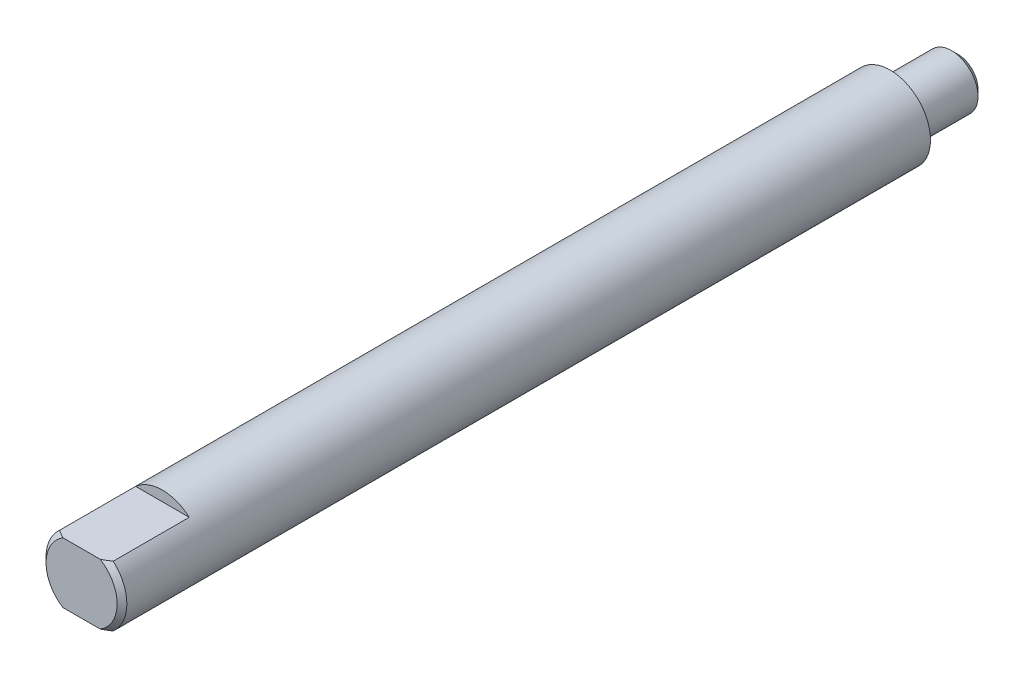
ISO-10303-21;
HEADER;
FILE_DESCRIPTION(('STEP AP214'),'2;1');
FILE_NAME('part.step','',(''),(''),'','','');
FILE_SCHEMA(('AUTOMOTIVE_DESIGN { 1 0 10303 214 1 1 1 1 }'));
ENDSEC;
DATA;
#1=APPLICATION_CONTEXT('core data for automotive mechanical design processes');
#2=APPLICATION_PROTOCOL_DEFINITION('international standard','automotive_design',2000,#1);
#3=PRODUCT_CONTEXT('',#1,'mechanical');
#4=PRODUCT('Part','Part','',(#3));
#5=PRODUCT_RELATED_PRODUCT_CATEGORY('part','',(#4));
#6=PRODUCT_DEFINITION_FORMATION('','',#4);
#7=PRODUCT_DEFINITION_CONTEXT('part definition',#1,'design');
#8=PRODUCT_DEFINITION('design','',#6,#7);
#9=PRODUCT_DEFINITION_SHAPE('','',#8);
#10=(LENGTH_UNIT() NAMED_UNIT(*) SI_UNIT(.MILLI.,.METRE.));
#11=(NAMED_UNIT(*) PLANE_ANGLE_UNIT() SI_UNIT($,.RADIAN.));
#12=(NAMED_UNIT(*) SI_UNIT($,.STERADIAN.) SOLID_ANGLE_UNIT());
#13=UNCERTAINTY_MEASURE_WITH_UNIT(LENGTH_MEASURE(1.E-05),#10,'distance_accuracy_value','');
#14=(GEOMETRIC_REPRESENTATION_CONTEXT(3) GLOBAL_UNCERTAINTY_ASSIGNED_CONTEXT((#13)) GLOBAL_UNIT_ASSIGNED_CONTEXT((#10,
#11,#12)) REPRESENTATION_CONTEXT('',''));
#15=CARTESIAN_POINT('',(0.,0.,0.));
#16=DIRECTION('',(0.,0.,1.));
#17=DIRECTION('',(1.,0.,0.));
#18=AXIS2_PLACEMENT_3D('',#15,#16,#17);
#19=CARTESIAN_POINT('',(0.,0.,3.684));
#20=DIRECTION('',(0.,0.,-1.));
#21=DIRECTION('',(0.,1.,0.));
#22=AXIS2_PLACEMENT_3D('',#19,#20,#21);
#23=CONICAL_SURFACE('',#22,3.175,0.791934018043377);
#24=CARTESIAN_POINT('',(0.,0.,3.684));
#25=DIRECTION('',(0.,0.,1.));
#26=DIRECTION('',(0.,-1.,0.));
#27=AXIS2_PLACEMENT_3D('',#24,#25,#26);
#28=CIRCLE('',#27,3.175);
#29=CARTESIAN_POINT('',(-2.10713075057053,2.37500000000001,3.684));
#30=VERTEX_POINT('',#29);
#31=CARTESIAN_POINT('',(-2.10713075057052,-2.37500000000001,3.684));
#32=VERTEX_POINT('',#31);
#33=EDGE_CURVE('E105',#30,#32,#28,.T.);
#34=ORIENTED_EDGE('',*,*,#33,.T.);
#35=CARTESIAN_POINT('',(-6.62966945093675,-2.37500000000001,-0.133015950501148));
#36=CARTESIAN_POINT('',(-6.41872085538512,-2.37500000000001,0.0629362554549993));
#37=CARTESIAN_POINT('',(-6.20729327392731,-2.37500000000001,0.258380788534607));
#38=CARTESIAN_POINT('',(-5.7828601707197,-2.37500000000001,0.647887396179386));
#39=CARTESIAN_POINT('',(-5.56985352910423,-2.37500000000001,0.841948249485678));
#40=CARTESIAN_POINT('',(-5.1357405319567,-2.37500000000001,1.23363349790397));
#41=CARTESIAN_POINT('',(-4.91457904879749,-2.37500000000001,1.43119690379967));
#42=CARTESIAN_POINT('',(-4.46963283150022,-2.37500000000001,1.82304516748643));
#43=CARTESIAN_POINT('',(-4.24585006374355,-2.37500000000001,2.0173322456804));
#44=CARTESIAN_POINT('',(-3.90719638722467,-2.37500000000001,2.30510248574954));
#45=CARTESIAN_POINT('',(-3.79385459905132,-2.37500000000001,2.40038380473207));
#46=CARTESIAN_POINT('',(-3.56590809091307,-2.37500000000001,2.58942155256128));
#47=CARTESIAN_POINT('',(-3.45130340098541,-2.37500000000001,2.68317801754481));
#48=CARTESIAN_POINT('',(-3.22025369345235,-2.37500000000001,2.86895465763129));
#49=CARTESIAN_POINT('',(-3.10380502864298,-2.37500000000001,2.96097030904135));
#50=CARTESIAN_POINT('',(-2.86892224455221,-2.37500000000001,3.14241965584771));
#51=CARTESIAN_POINT('',(-2.75048831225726,-2.37500000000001,3.23185359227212));
#52=CARTESIAN_POINT('',(-2.51255729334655,-2.37500000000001,3.40617108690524));
#53=CARTESIAN_POINT('',(-2.39309165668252,-2.37500000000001,3.49109735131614));
#54=CARTESIAN_POINT('',(-2.15090508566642,-2.37500000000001,3.65634247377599));
#55=CARTESIAN_POINT('',(-2.02818269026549,-2.37500000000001,3.73665921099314));
#56=CARTESIAN_POINT('',(-1.77912466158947,-2.37500000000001,3.89039659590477));
#57=CARTESIAN_POINT('',(-1.65280524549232,-2.37500000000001,3.96384327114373));
#58=CARTESIAN_POINT('',(-1.39512518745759,-2.37500000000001,4.10119391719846));
#59=CARTESIAN_POINT('',(-1.26377071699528,-2.37500000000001,4.16510912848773));
#60=CARTESIAN_POINT('',(-1.05701971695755,-2.37500000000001,4.25273595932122));
#61=CARTESIAN_POINT('',(-0.983728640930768,-2.37500000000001,4.28140199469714));
#62=CARTESIAN_POINT('',(-0.835356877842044,-2.37500000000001,4.33377721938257));
#63=CARTESIAN_POINT('',(-0.760275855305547,-2.37500000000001,4.35748547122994));
#64=CARTESIAN_POINT('',(-0.608898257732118,-2.37500000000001,4.39885359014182));
#65=CARTESIAN_POINT('',(-0.532610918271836,-2.37500000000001,4.41654679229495));
#66=CARTESIAN_POINT('',(-0.378780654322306,-2.37500000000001,4.44515427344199));
#67=CARTESIAN_POINT('',(-0.301238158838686,-2.37500000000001,4.45607082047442));
#68=CARTESIAN_POINT('',(-0.144559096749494,-2.37500000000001,4.47054748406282));
#69=CARTESIAN_POINT('',(-0.0654144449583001,-2.37500000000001,4.47402190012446));
#70=CARTESIAN_POINT('',(0.0928249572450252,-2.37500000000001,4.47312081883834));
#71=CARTESIAN_POINT('',(0.171919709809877,-2.37500000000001,4.4687456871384));
#72=CARTESIAN_POINT('',(0.329626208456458,-2.37500000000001,4.45241265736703));
#73=CARTESIAN_POINT('',(0.408234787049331,-2.37500000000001,4.44042470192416));
#74=CARTESIAN_POINT('',(0.564086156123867,-2.37500000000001,4.40957980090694));
#75=CARTESIAN_POINT('',(0.641328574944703,-2.37500000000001,4.39072101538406));
#76=CARTESIAN_POINT('',(0.827865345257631,-2.37500000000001,4.33746225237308));
#77=CARTESIAN_POINT('',(0.936246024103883,-2.37500000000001,4.29987709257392));
#78=CARTESIAN_POINT('',(1.14927492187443,-2.37500000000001,4.21535984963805));
#79=CARTESIAN_POINT('',(1.25392057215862,-2.37500000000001,4.16842147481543));
#80=CARTESIAN_POINT('',(1.46087103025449,-2.37500000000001,4.06709514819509));
#81=CARTESIAN_POINT('',(1.56313950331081,-2.37500000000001,4.01263383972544));
#82=CARTESIAN_POINT('',(1.71427099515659,-2.37500000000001,3.92703840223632));
#83=CARTESIAN_POINT('',(1.76426245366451,-2.37500000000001,3.89786057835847));
#84=CARTESIAN_POINT('',(1.86356372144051,-2.37500000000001,3.8383700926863));
#85=CARTESIAN_POINT('',(1.91287355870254,-2.37500000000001,3.80805747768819));
#86=CARTESIAN_POINT('',(2.07522042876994,-2.37500000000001,3.70601224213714));
#87=CARTESIAN_POINT('',(2.18692206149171,-2.37500000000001,3.63215349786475));
#88=CARTESIAN_POINT('',(2.40772318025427,-2.37500000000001,3.48062951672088));
#89=CARTESIAN_POINT('',(2.51682205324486,-2.37500000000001,3.40296339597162));
#90=CARTESIAN_POINT('',(2.73301390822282,-2.37500000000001,3.24473477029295));
#91=CARTESIAN_POINT('',(2.84010537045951,-2.37500000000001,3.16417019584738));
#92=CARTESIAN_POINT('',(3.05261723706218,-2.37500000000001,3.00086187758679));
#93=CARTESIAN_POINT('',(3.15803753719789,-2.37500000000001,2.91811799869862));
#94=CARTESIAN_POINT('',(3.47300086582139,-2.37500000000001,2.66679989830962));
#95=CARTESIAN_POINT('',(3.68051445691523,-2.37500000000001,2.4956856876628));
#96=CARTESIAN_POINT('',(4.09182405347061,-2.37500000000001,2.14926116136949));
#97=CARTESIAN_POINT('',(4.29562161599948,-2.37500000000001,1.97395267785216));
#98=CARTESIAN_POINT('',(4.67931232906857,-2.37500000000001,1.63905531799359));
#99=CARTESIAN_POINT('',(4.85946034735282,-2.37500000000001,1.47975783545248));
#100=CARTESIAN_POINT('',(5.21824582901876,-2.37500000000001,1.15942835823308));
#101=CARTESIAN_POINT('',(5.3968830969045,-2.37500000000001,0.998396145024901));
#102=CARTESIAN_POINT('',(5.75173692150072,-2.37500000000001,0.676174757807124));
#103=CARTESIAN_POINT('',(5.92796166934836,-2.37500000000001,0.514994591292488));
#104=CARTESIAN_POINT('',(6.27946145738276,-2.37500000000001,0.191659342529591));
#105=CARTESIAN_POINT('',(6.45473664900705,-2.37500000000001,0.0295044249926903));
#106=CARTESIAN_POINT('',(6.62966945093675,-2.37500000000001,-0.13301595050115));
#107=B_SPLINE_CURVE_WITH_KNOTS('',3,(#35,#36,#37,#38,#39,#40,#41,#42,#43,#44,#45,#46,#47,#48,
#49,#50,#51,#52,#53,#54,#55,#56,#57,#58,#59,#60,#61,#62,#63,#64,#65,#66,#67,#68,#69,#70,#71,#72,
#73,#74,#75,#76,#77,#78,#79,#80,#81,#82,#83,#84,#85,#86,#87,#88,#89,#90,#91,#92,#93,#94,#95,#96,
#97,#98,#99,#100,#101,#102,#103,#104,#105,#106),.UNSPECIFIED.,.F.,.F.,(4,2,2,2,2,2,2,2,2,2,2,2,
2,2,2,2,2,2,2,2,2,2,2,2,2,2,2,2,2,2,2,2,2,2,2,4),(0.,0.863760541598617,1.72820709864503,
2.61784876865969,3.50686109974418,3.95106286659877,4.39525409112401,4.84047397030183,
5.28565214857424,5.72530383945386,6.16515621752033,6.60326828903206,7.04085953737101,
7.27681206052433,7.51280915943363,7.74747620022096,7.98206465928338,8.21934033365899,
8.4566049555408,8.69481223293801,8.9330833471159,9.27660606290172,9.62036064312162,
9.96774119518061,10.1413805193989,10.3150126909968,10.7166254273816,11.118331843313,
11.5203310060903,11.9223551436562,12.7291420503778,13.535582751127,14.2569976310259,
14.9785044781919,15.6949553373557,16.4112883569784),.UNSPECIFIED.);
#108=CARTESIAN_POINT('',(-1.4640611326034,-2.37500000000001,4.064));
#109=VERTEX_POINT('',#108);
#110=EDGE_CURVE('E128',#32,#109,#107,.T.);
#111=ORIENTED_EDGE('',*,*,#110,.T.);
#112=CARTESIAN_POINT('',(0.,0.,4.064));
#113=DIRECTION('',(0.,0.,1.));
#114=DIRECTION('',(0.,-1.,0.));
#115=AXIS2_PLACEMENT_3D('',#112,#113,#114);
#116=CIRCLE('',#115,2.79);
#117=CARTESIAN_POINT('',(-1.46406113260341,2.37500000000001,4.064));
#118=VERTEX_POINT('',#117);
#119=EDGE_CURVE('E115',#118,#109,#116,.T.);
#120=ORIENTED_EDGE('',*,*,#119,.F.);
#121=CARTESIAN_POINT('',(6.62966945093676,2.37500000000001,-0.13301595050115));
#122=CARTESIAN_POINT('',(6.41872085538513,2.37500000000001,0.0629362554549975));
#123=CARTESIAN_POINT('',(6.20729327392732,2.37500000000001,0.258380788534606));
#124=CARTESIAN_POINT('',(5.7828601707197,2.37500000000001,0.647887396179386));
#125=CARTESIAN_POINT('',(5.56985352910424,2.37500000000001,0.841948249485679));
#126=CARTESIAN_POINT('',(5.13574053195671,2.37500000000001,1.23363349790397));
#127=CARTESIAN_POINT('',(4.91457904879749,2.37500000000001,1.43119690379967));
#128=CARTESIAN_POINT('',(4.46963283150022,2.37500000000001,1.82304516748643));
#129=CARTESIAN_POINT('',(4.24585006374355,2.37500000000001,2.0173322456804));
#130=CARTESIAN_POINT('',(3.90719638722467,2.37500000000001,2.30510248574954));
#131=CARTESIAN_POINT('',(3.79385459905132,2.37500000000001,2.40038380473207));
#132=CARTESIAN_POINT('',(3.56590809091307,2.37500000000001,2.58942155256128));
#133=CARTESIAN_POINT('',(3.45130340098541,2.37500000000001,2.68317801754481));
#134=CARTESIAN_POINT('',(3.22025369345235,2.37500000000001,2.8689546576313));
#135=CARTESIAN_POINT('',(3.10380502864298,2.37500000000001,2.96097030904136));
#136=CARTESIAN_POINT('',(2.86892224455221,2.37500000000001,3.14241965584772));
#137=CARTESIAN_POINT('',(2.75048831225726,2.37500000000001,3.23185359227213));
#138=CARTESIAN_POINT('',(2.51255729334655,2.37500000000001,3.40617108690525));
#139=CARTESIAN_POINT('',(2.39309165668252,2.37500000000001,3.49109735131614));
#140=CARTESIAN_POINT('',(2.15090508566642,2.37500000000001,3.656342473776));
#141=CARTESIAN_POINT('',(2.02818269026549,2.37500000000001,3.73665921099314));
#142=CARTESIAN_POINT('',(1.77912466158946,2.37500000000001,3.89039659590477));
#143=CARTESIAN_POINT('',(1.65280524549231,2.37500000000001,3.96384327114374));
#144=CARTESIAN_POINT('',(1.39512518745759,2.37500000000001,4.10119391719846));
#145=CARTESIAN_POINT('',(1.26377071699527,2.37500000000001,4.16510912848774));
#146=CARTESIAN_POINT('',(1.05701971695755,2.37500000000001,4.25273595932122));
#147=CARTESIAN_POINT('',(0.983728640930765,2.37500000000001,4.28140199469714));
#148=CARTESIAN_POINT('',(0.835356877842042,2.37500000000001,4.33377721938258));
#149=CARTESIAN_POINT('',(0.760275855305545,2.37500000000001,4.35748547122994));
#150=CARTESIAN_POINT('',(0.608898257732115,2.37500000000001,4.39885359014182));
#151=CARTESIAN_POINT('',(0.532610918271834,2.37500000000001,4.41654679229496));
#152=CARTESIAN_POINT('',(0.378780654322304,2.37500000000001,4.44515427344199));
#153=CARTESIAN_POINT('',(0.301238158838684,2.37500000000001,4.45607082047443));
#154=CARTESIAN_POINT('',(0.144559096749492,2.37500000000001,4.47054748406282));
#155=CARTESIAN_POINT('',(0.065414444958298,2.37500000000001,4.47402190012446));
#156=CARTESIAN_POINT('',(-0.0928249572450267,2.37500000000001,4.47312081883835));
#157=CARTESIAN_POINT('',(-0.171919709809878,2.37500000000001,4.4687456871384));
#158=CARTESIAN_POINT('',(-0.329626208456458,2.37500000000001,4.45241265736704));
#159=CARTESIAN_POINT('',(-0.408234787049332,2.37500000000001,4.44042470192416));
#160=CARTESIAN_POINT('',(-0.564086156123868,2.37500000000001,4.40957980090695));
#161=CARTESIAN_POINT('',(-0.641328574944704,2.37500000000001,4.39072101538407));
#162=CARTESIAN_POINT('',(-0.827865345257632,2.37500000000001,4.33746225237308));
#163=CARTESIAN_POINT('',(-0.936246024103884,2.37500000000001,4.29987709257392));
#164=CARTESIAN_POINT('',(-1.14927492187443,2.37500000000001,4.21535984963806));
#165=CARTESIAN_POINT('',(-1.25392057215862,2.37500000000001,4.16842147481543));
#166=CARTESIAN_POINT('',(-1.46087103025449,2.37500000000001,4.06709514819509));
#167=CARTESIAN_POINT('',(-1.56313950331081,2.37500000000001,4.01263383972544));
#168=CARTESIAN_POINT('',(-1.7142709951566,2.37500000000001,3.92703840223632));
#169=CARTESIAN_POINT('',(-1.76426245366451,2.37500000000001,3.89786057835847));
#170=CARTESIAN_POINT('',(-1.86356372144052,2.37500000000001,3.83837009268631));
#171=CARTESIAN_POINT('',(-1.91287355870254,2.37500000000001,3.80805747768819));
#172=CARTESIAN_POINT('',(-2.07522042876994,2.37500000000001,3.70601224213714));
#173=CARTESIAN_POINT('',(-2.18692206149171,2.37500000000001,3.63215349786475));
#174=CARTESIAN_POINT('',(-2.40772318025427,2.37500000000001,3.48062951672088));
#175=CARTESIAN_POINT('',(-2.51682205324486,2.37500000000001,3.40296339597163));
#176=CARTESIAN_POINT('',(-2.73301390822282,2.37500000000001,3.24473477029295));
#177=CARTESIAN_POINT('',(-2.84010537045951,2.37500000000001,3.16417019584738));
#178=CARTESIAN_POINT('',(-3.05261723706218,2.37500000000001,3.00086187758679));
#179=CARTESIAN_POINT('',(-3.15803753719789,2.37500000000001,2.91811799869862));
#180=CARTESIAN_POINT('',(-3.4730008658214,2.37500000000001,2.66679989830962));
#181=CARTESIAN_POINT('',(-3.68051445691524,2.37500000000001,2.4956856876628));
#182=CARTESIAN_POINT('',(-4.09182405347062,2.37500000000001,2.14926116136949));
#183=CARTESIAN_POINT('',(-4.29562161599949,2.37500000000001,1.97395267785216));
#184=CARTESIAN_POINT('',(-4.67931232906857,2.37500000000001,1.63905531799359));
#185=CARTESIAN_POINT('',(-4.85946034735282,2.37500000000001,1.47975783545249));
#186=CARTESIAN_POINT('',(-5.21824582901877,2.37500000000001,1.15942835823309));
#187=CARTESIAN_POINT('',(-5.3968830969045,2.37500000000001,0.998396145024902));
#188=CARTESIAN_POINT('',(-5.75173692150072,2.37500000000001,0.676174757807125));
#189=CARTESIAN_POINT('',(-5.92796166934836,2.37500000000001,0.514994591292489));
#190=CARTESIAN_POINT('',(-6.27946145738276,2.37500000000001,0.191659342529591));
#191=CARTESIAN_POINT('',(-6.45473664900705,2.37500000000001,0.0295044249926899));
#192=CARTESIAN_POINT('',(-6.62966945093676,2.37500000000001,-0.13301595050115));
#193=B_SPLINE_CURVE_WITH_KNOTS('',3,(#121,#122,#123,#124,#125,#126,#127,#128,#129,#130,#131,
#132,#133,#134,#135,#136,#137,#138,#139,#140,#141,#142,#143,#144,#145,#146,#147,#148,#149,#150,
#151,#152,#153,#154,#155,#156,#157,#158,#159,#160,#161,#162,#163,#164,#165,#166,#167,#168,#169,
#170,#171,#172,#173,#174,#175,#176,#177,#178,#179,#180,#181,#182,#183,#184,#185,#186,#187,#188,
#189,#190,#191,#192),.UNSPECIFIED.,.F.,.F.,(4,2,2,2,2,2,2,2,2,2,2,2,2,2,2,2,2,2,2,2,2,2,2,2,2,2,
2,2,2,2,2,2,2,2,2,4),(0.,0.863760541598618,1.72820709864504,2.61784876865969,3.50686109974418,
3.95106286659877,4.39525409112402,4.84047397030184,5.28565214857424,5.72530383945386,
6.16515621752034,6.60326828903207,7.04085953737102,7.27681206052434,7.51280915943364,
7.74747620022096,7.98206465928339,8.219340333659,8.45660495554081,8.69481223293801,
8.9330833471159,9.27660606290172,9.62036064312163,9.96774119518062,10.1413805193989,
10.3150126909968,10.7166254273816,11.118331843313,11.5203310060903,11.9223551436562,
12.7291420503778,13.535582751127,14.2569976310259,14.9785044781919,15.6949553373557,
16.4112883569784),.UNSPECIFIED.);
#194=EDGE_CURVE('E129',#118,#30,#193,.T.);
#195=ORIENTED_EDGE('',*,*,#194,.T.);
#196=EDGE_LOOP('',(#34,#111,#120,#195));
#197=FACE_BOUND('',#196,.T.);
#198=ADVANCED_FACE('F33',(#197),#23,.T.);
#199=CARTESIAN_POINT('',(0.,0.,4.064));
#200=DIRECTION('',(0.,0.,-1.));
#201=DIRECTION('',(0.,1.,0.));
#202=AXIS2_PLACEMENT_3D('',#199,#200,#201);
#203=PLANE('',#202);
#204=ORIENTED_EDGE('',*,*,#119,.T.);
#205=DIRECTION('',(1.,0.,0.));
#206=VECTOR('',#205,1.);
#207=CARTESIAN_POINT('',(-5.,-2.37500000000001,4.064));
#208=LINE('',#207,#206);
#209=CARTESIAN_POINT('',(1.4640611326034,-2.37500000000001,4.064));
#210=VERTEX_POINT('',#209);
#211=EDGE_CURVE('E95',#109,#210,#208,.T.);
#212=ORIENTED_EDGE('',*,*,#211,.T.);
#213=CARTESIAN_POINT('',(1.46406113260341,2.37500000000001,4.064));
#214=VERTEX_POINT('',#213);
#215=EDGE_CURVE('E109',#210,#214,#116,.T.);
#216=ORIENTED_EDGE('',*,*,#215,.T.);
#217=DIRECTION('',(1.,0.,0.));
#218=VECTOR('',#217,1.);
#219=CARTESIAN_POINT('',(-5.,2.37500000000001,4.064));
#220=LINE('',#219,#218);
#221=EDGE_CURVE('E135',#118,#214,#220,.T.);
#222=ORIENTED_EDGE('',*,*,#221,.F.);
#223=EDGE_LOOP('',(#204,#212,#216,#222));
#224=FACE_BOUND('',#223,.T.);
#225=ADVANCED_FACE('F35',(#224),#203,.F.);
#226=ORIENTED_EDGE('',*,*,#215,.F.);
#227=CARTESIAN_POINT('',(2.10713075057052,-2.37500000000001,3.684));
#228=VERTEX_POINT('',#227);
#229=EDGE_CURVE('E94',#210,#228,#107,.T.);
#230=ORIENTED_EDGE('',*,*,#229,.T.);
#231=CARTESIAN_POINT('',(2.10713075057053,2.37500000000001,3.684));
#232=VERTEX_POINT('',#231);
#233=EDGE_CURVE('E101',#228,#232,#28,.T.);
#234=ORIENTED_EDGE('',*,*,#233,.T.);
#235=EDGE_CURVE('E132',#232,#214,#193,.T.);
#236=ORIENTED_EDGE('',*,*,#235,.T.);
#237=EDGE_LOOP('',(#226,#230,#234,#236));
#238=FACE_BOUND('',#237,.T.);
#239=ADVANCED_FACE('F144',(#238),#23,.T.);
#240=CARTESIAN_POINT('',(0.,0.,4.064));
#241=DIRECTION('',(0.,0.,1.));
#242=DIRECTION('',(0.,-1.,0.));
#243=AXIS2_PLACEMENT_3D('',#240,#241,#242);
#244=CYLINDRICAL_SURFACE('',#243,3.17499999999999);
#245=ORIENTED_EDGE('',*,*,#233,.F.);
#246=DIRECTION('',(0.,0.,1.));
#247=VECTOR('',#246,1.);
#248=CARTESIAN_POINT('',(2.10713075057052,-2.37500000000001,4.064));
#249=LINE('',#248,#247);
#250=CARTESIAN_POINT('',(2.10713075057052,-2.37500000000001,-2.286));
#251=VERTEX_POINT('',#250);
#252=EDGE_CURVE('E11',#228,#251,#249,.F.);
#253=ORIENTED_EDGE('',*,*,#252,.T.);
#254=CARTESIAN_POINT('',(0.,0.,-2.286));
#255=DIRECTION('',(0.,0.,-1.));
#256=DIRECTION('',(-1.,0.,0.));
#257=AXIS2_PLACEMENT_3D('',#254,#255,#256);
#258=CIRCLE('',#257,3.17499999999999);
#259=CARTESIAN_POINT('',(-2.10713075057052,-2.37500000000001,-2.286));
#260=VERTEX_POINT('',#259);
#261=EDGE_CURVE('E85',#251,#260,#258,.T.);
#262=ORIENTED_EDGE('',*,*,#261,.T.);
#263=DIRECTION('',(0.,0.,1.));
#264=VECTOR('',#263,1.);
#265=CARTESIAN_POINT('',(-2.10713075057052,-2.37500000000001,4.064));
#266=LINE('',#265,#264);
#267=EDGE_CURVE('E41',#260,#32,#266,.T.);
#268=ORIENTED_EDGE('',*,*,#267,.T.);
#269=ORIENTED_EDGE('',*,*,#33,.F.);
#270=DIRECTION('',(0.,0.,1.));
#271=VECTOR('',#270,1.);
#272=CARTESIAN_POINT('',(-2.10713075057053,2.37500000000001,4.064));
#273=LINE('',#272,#271);
#274=CARTESIAN_POINT('',(-2.10713075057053,2.37500000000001,-2.286));
#275=VERTEX_POINT('',#274);
#276=EDGE_CURVE('E118',#30,#275,#273,.F.);
#277=ORIENTED_EDGE('',*,*,#276,.T.);
#278=CARTESIAN_POINT('',(0.,0.,-2.286));
#279=DIRECTION('',(0.,0.,-1.));
#280=DIRECTION('',(-1.,0.,0.));
#281=AXIS2_PLACEMENT_3D('',#278,#279,#280);
#282=CIRCLE('',#281,3.17499999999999);
#283=CARTESIAN_POINT('',(2.10713075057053,2.37500000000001,-2.286));
#284=VERTEX_POINT('',#283);
#285=EDGE_CURVE('E121',#275,#284,#282,.T.);
#286=ORIENTED_EDGE('',*,*,#285,.T.);
#287=DIRECTION('',(0.,0.,1.));
#288=VECTOR('',#287,1.);
#289=CARTESIAN_POINT('',(2.10713075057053,2.37500000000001,4.064));
#290=LINE('',#289,#288);
#291=EDGE_CURVE('E89',#284,#232,#290,.T.);
#292=ORIENTED_EDGE('',*,*,#291,.T.);
#293=EDGE_LOOP('',(#245,#253,#262,#268,#269,#277,#286,#292));
#294=FACE_BOUND('',#293,.T.);
#295=CARTESIAN_POINT('',(0.,0.,-59.436));
#296=DIRECTION('',(0.,0.,1.));
#297=DIRECTION('',(0.,-1.,0.));
#298=AXIS2_PLACEMENT_3D('',#295,#296,#297);
#299=CIRCLE('',#298,3.17499999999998);
#300=CARTESIAN_POINT('',(0.,-3.17499999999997,-59.436));
#301=VERTEX_POINT('',#300);
#302=EDGE_CURVE('E106',#301,#301,#299,.T.);
#303=ORIENTED_EDGE('',*,*,#302,.T.);
#304=EDGE_LOOP('',(#303));
#305=FACE_BOUND('',#304,.T.);
#306=ADVANCED_FACE('F98',(#294,#305),#244,.T.);
#307=CARTESIAN_POINT('',(0.,2.08280000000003,-59.436));
#308=DIRECTION('',(0.,0.,1.));
#309=DIRECTION('',(0.,-1.,0.));
#310=AXIS2_PLACEMENT_3D('',#307,#308,#309);
#311=PLANE('',#310);
#312=ORIENTED_EDGE('',*,*,#302,.F.);
#313=EDGE_LOOP('',(#312));
#314=FACE_BOUND('',#313,.T.);
#315=CARTESIAN_POINT('',(0.,0.,-59.436));
#316=DIRECTION('',(0.,0.,1.));
#317=DIRECTION('',(0.,-1.,0.));
#318=AXIS2_PLACEMENT_3D('',#315,#316,#317);
#319=CIRCLE('',#318,2.08280000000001);
#320=CARTESIAN_POINT('',(0.,-2.08279999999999,-59.436));
#321=VERTEX_POINT('',#320);
#322=EDGE_CURVE('E111',#321,#321,#319,.T.);
#323=ORIENTED_EDGE('',*,*,#322,.T.);
#324=EDGE_LOOP('',(#323));
#325=FACE_BOUND('',#324,.T.);
#326=ADVANCED_FACE('F165',(#314,#325),#311,.F.);
#327=CARTESIAN_POINT('',(0.,0.,4.064));
#328=DIRECTION('',(0.,0.,1.));
#329=DIRECTION('',(0.,-1.,0.));
#330=AXIS2_PLACEMENT_3D('',#327,#328,#329);
#331=CYLINDRICAL_SURFACE('',#330,2.08280000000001);
#332=ORIENTED_EDGE('',*,*,#322,.F.);
#333=EDGE_LOOP('',(#332));
#334=FACE_BOUND('',#333,.T.);
#335=CARTESIAN_POINT('',(0.,0.,-64.26));
#336=DIRECTION('',(0.,0.,1.));
#337=DIRECTION('',(0.,-1.,0.));
#338=AXIS2_PLACEMENT_3D('',#335,#336,#337);
#339=CIRCLE('',#338,2.08280000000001);
#340=CARTESIAN_POINT('',(0.,-2.08279999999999,-64.26));
#341=VERTEX_POINT('',#340);
#342=EDGE_CURVE('E263',#341,#341,#339,.T.);
#343=ORIENTED_EDGE('',*,*,#342,.T.);
#344=EDGE_LOOP('',(#343));
#345=FACE_BOUND('',#344,.T.);
#346=ADVANCED_FACE('F161',(#334,#345),#331,.T.);
#347=CARTESIAN_POINT('',(0.,0.,-64.77));
#348=DIRECTION('',(0.,0.,1.));
#349=DIRECTION('',(0.,-1.,0.));
#350=AXIS2_PLACEMENT_3D('',#347,#348,#349);
#351=CONICAL_SURFACE('',#350,1.57,0.788135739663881);
#352=ORIENTED_EDGE('',*,*,#342,.F.);
#353=EDGE_LOOP('',(#352));
#354=FACE_BOUND('',#353,.T.);
#355=CARTESIAN_POINT('',(0.,0.,-64.77));
#356=DIRECTION('',(0.,0.,1.));
#357=DIRECTION('',(0.,-1.,0.));
#358=AXIS2_PLACEMENT_3D('',#355,#356,#357);
#359=CIRCLE('',#358,1.57);
#360=CARTESIAN_POINT('',(0.,-1.56999999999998,-64.77));
#361=VERTEX_POINT('',#360);
#362=EDGE_CURVE('E134',#361,#361,#359,.T.);
#363=ORIENTED_EDGE('',*,*,#362,.T.);
#364=EDGE_LOOP('',(#363));
#365=FACE_BOUND('',#364,.T.);
#366=ADVANCED_FACE('F157',(#354,#365),#351,.T.);
#367=CARTESIAN_POINT('',(0.,0.,-64.77));
#368=DIRECTION('',(0.,0.,1.));
#369=DIRECTION('',(0.,-1.,0.));
#370=AXIS2_PLACEMENT_3D('',#367,#368,#369);
#371=PLANE('',#370);
#372=ORIENTED_EDGE('',*,*,#362,.F.);
#373=EDGE_LOOP('',(#372));
#374=FACE_BOUND('',#373,.T.);
#375=ADVANCED_FACE('F154',(#374),#371,.F.);
#376=CARTESIAN_POINT('',(-5.,2.37500000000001,-2.286));
#377=DIRECTION('',(0.,0.,-1.));
#378=DIRECTION('',(-1.,0.,0.));
#379=AXIS2_PLACEMENT_3D('',#376,#377,#378);
#380=PLANE('',#379);
#381=DIRECTION('',(1.,0.,0.));
#382=VECTOR('',#381,1.);
#383=CARTESIAN_POINT('',(-5.,2.37500000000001,-2.286));
#384=LINE('',#383,#382);
#385=EDGE_CURVE('E55',#275,#284,#384,.T.);
#386=ORIENTED_EDGE('',*,*,#385,.T.);
#387=ORIENTED_EDGE('',*,*,#285,.F.);
#388=EDGE_LOOP('',(#386,#387));
#389=FACE_BOUND('',#388,.T.);
#390=ADVANCED_FACE('F152',(#389),#380,.F.);
#391=CARTESIAN_POINT('',(-5.,2.37500000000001,4.064));
#392=DIRECTION('',(0.,-1.,0.));
#393=DIRECTION('',(0.,0.,-1.));
#394=AXIS2_PLACEMENT_3D('',#391,#392,#393);
#395=PLANE('',#394);
#396=ORIENTED_EDGE('',*,*,#291,.F.);
#397=ORIENTED_EDGE('',*,*,#385,.F.);
#398=ORIENTED_EDGE('',*,*,#276,.F.);
#399=ORIENTED_EDGE('',*,*,#194,.F.);
#400=ORIENTED_EDGE('',*,*,#221,.T.);
#401=ORIENTED_EDGE('',*,*,#235,.F.);
#402=EDGE_LOOP('',(#396,#397,#398,#399,#400,#401));
#403=FACE_BOUND('',#402,.T.);
#404=ADVANCED_FACE('F147',(#403),#395,.F.);
#405=CARTESIAN_POINT('',(-5.,-2.37500000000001,4.064));
#406=DIRECTION('',(0.,1.,0.));
#407=DIRECTION('',(0.,0.,1.));
#408=AXIS2_PLACEMENT_3D('',#405,#406,#407);
#409=PLANE('',#408);
#410=ORIENTED_EDGE('',*,*,#267,.F.);
#411=DIRECTION('',(1.,0.,0.));
#412=VECTOR('',#411,1.);
#413=CARTESIAN_POINT('',(-5.,-2.37500000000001,-2.286));
#414=LINE('',#413,#412);
#415=EDGE_CURVE('E47',#260,#251,#414,.T.);
#416=ORIENTED_EDGE('',*,*,#415,.T.);
#417=ORIENTED_EDGE('',*,*,#252,.F.);
#418=ORIENTED_EDGE('',*,*,#229,.F.);
#419=ORIENTED_EDGE('',*,*,#211,.F.);
#420=ORIENTED_EDGE('',*,*,#110,.F.);
#421=EDGE_LOOP('',(#410,#416,#417,#418,#419,#420));
#422=FACE_BOUND('',#421,.T.);
#423=ADVANCED_FACE('F92',(#422),#409,.F.);
#424=CARTESIAN_POINT('',(-5.,-2.37500000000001,-2.286));
#425=DIRECTION('',(0.,0.,-1.));
#426=DIRECTION('',(-1.,0.,0.));
#427=AXIS2_PLACEMENT_3D('',#424,#425,#426);
#428=PLANE('',#427);
#429=ORIENTED_EDGE('',*,*,#415,.F.);
#430=ORIENTED_EDGE('',*,*,#261,.F.);
#431=EDGE_LOOP('',(#429,#430));
#432=FACE_BOUND('',#431,.T.);
#433=ADVANCED_FACE('F86',(#432),#428,.F.);
#434=CLOSED_SHELL('',(#198,#225,#239,#306,#326,#346,#366,#375,#390,#404,#423,#433));
#435=MANIFOLD_SOLID_BREP('B2',#434);
#436=ADVANCED_BREP_SHAPE_REPRESENTATION('',(#18,#435),#14);
#437=SHAPE_DEFINITION_REPRESENTATION(#9,#436);
ENDSEC;
END-ISO-10303-21;
